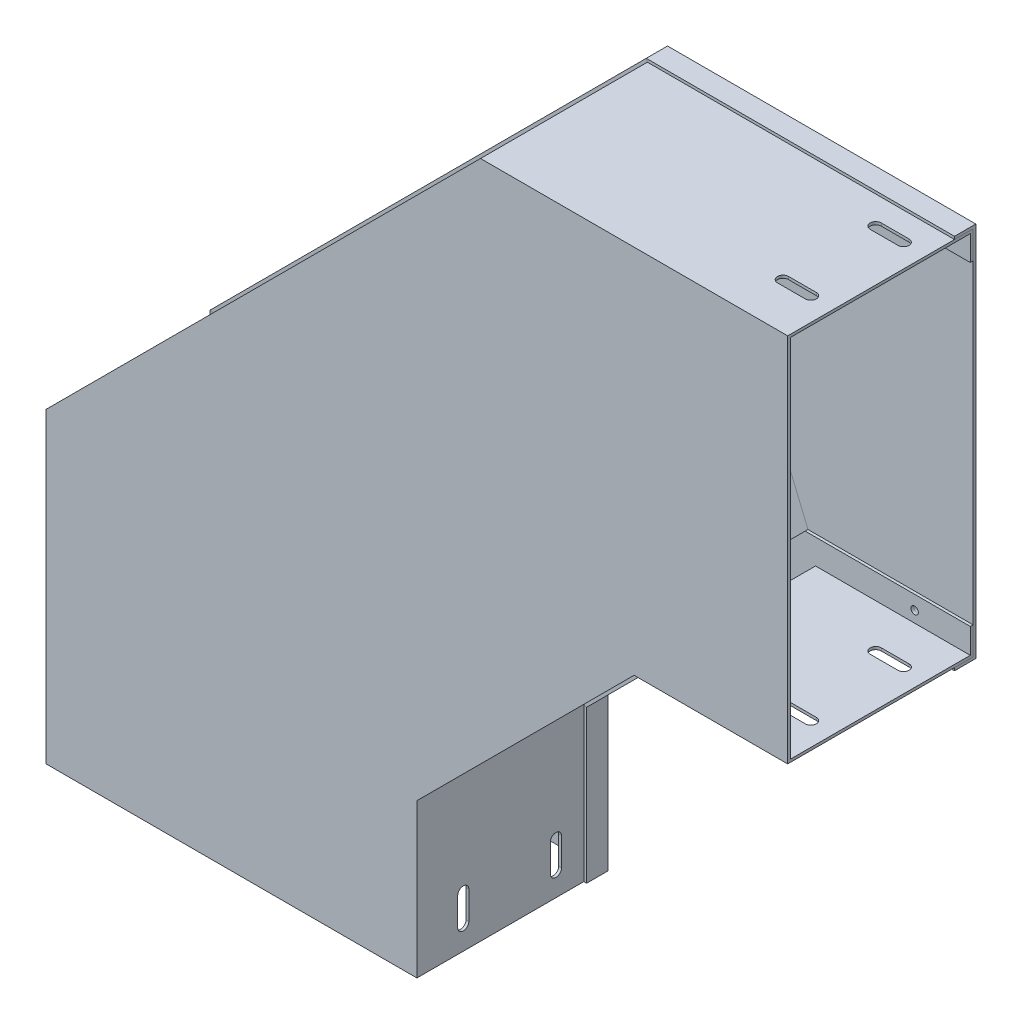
from build123d import *

# Parameters (mm, degrees)
CUT_EXTRUDE1_DEPTH      = 503.493781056
CUT_EXTRUDE1_DEPTH_BACK = 503.493781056
CUT_EXTRUDE2_DEPTH      = 503.493781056
CUT_EXTRUDE2_DEPTH_BACK = 503.493781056
SKETCH4_R               = 2
CUT_EXTRUDE3_DEPTH      = 568.89083458
CUT_EXTRUDE4_REACH      = 569.891
SKETCH5_R               = 2
SKETCH10_R              = 2
CUT_EXTRUDE5_DEPTH      = 571.13748342
SKETCH11_R              = 2
CUT_EXTRUDE6_DEPTH      = 571.13748342


with BuildPart() as part:
    # Sweep1: sweep along a path in ElbowArc
    with BuildLine(Plane.XY) as sweep1_path:
        Line((-300, 0), (-300, 124.264068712))
        Line((-300, 124.264068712), (-124.264068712, 300))
        Line((-124.264068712, 300), (0, 300))
    # Sketch1 → Sweep1 (sweep)
    with BuildSketch(Plane(origin=(0, 0, 0), x_dir=(1, 0, 0), z_dir=(0, 1, 0))):
        Polygon((-200, -50), (-400, -50), (-400, 50), (-385, 50), (-385, 48.5), (-398.5, 48.5), (-398.5, -48.5), (-201.5, -48.5), (-201.5, 48.5), (-215, 48.5), (-215, 50), (-200, 50), align=None)
    sweep(path=sweep1_path.line, transition=Transition.RIGHT)

    # Sketch2 → Cut-Extrude1 (cut, two sides: drawn at the far end of the back side and taken through both)
    with BuildSketch(Plane(origin=(-300, 0, 0), x_dir=(0, 0, -1), z_dir=(1, 0, 0)).offset(-CUT_EXTRUDE1_DEPTH_BACK)):
        with BuildLine():
            Line((-28, 12.5), (-28, 27.5))
            ThreePointArc((-28, 27.5), (-25, 30.5), (-22, 27.5))
            Line((-22, 27.5), (-22, 12.5))
            ThreePointArc((-22, 12.5), (-25, 9.5), (-28, 12.5))
        make_face()
        with BuildLine():
            Line((22, 12.5), (22, 27.5))
            ThreePointArc((22, 27.5), (25, 30.5), (28, 27.5))
            Line((28, 27.5), (28, 12.5))
            ThreePointArc((28, 12.5), (25, 9.5), (22, 12.5))
        make_face()
    extrude(amount=CUT_EXTRUDE1_DEPTH + CUT_EXTRUDE1_DEPTH_BACK, mode=Mode.SUBTRACT)

    # Sketch3 → Cut-Extrude2 (cut, two sides: drawn at the far end of the back side and taken through both)
    with BuildSketch(Plane(origin=(0, 300, 0), x_dir=(-1, 0, 0), z_dir=(0, 1, 0)).offset(-CUT_EXTRUDE2_DEPTH_BACK)):
        with BuildLine():
            Line((12.5, 28), (27.5, 28))
            ThreePointArc((27.5, 28), (30.5, 25), (27.5, 22))
            Line((27.5, 22), (12.5, 22))
            ThreePointArc((12.5, 22), (9.5, 25), (12.5, 28))
        make_face()
        with BuildLine():
            Line((12.5, -22), (27.5, -22))
            ThreePointArc((27.5, -22), (30.5, -25), (27.5, -28))
            Line((27.5, -28), (12.5, -28))
            ThreePointArc((12.5, -28), (9.5, -25), (12.5, -22))
        make_face()
    extrude(amount=CUT_EXTRUDE2_DEPTH + CUT_EXTRUDE2_DEPTH_BACK, mode=Mode.SUBTRACT)

    # Sketch4 → Cut-Extrude3 (cut, through all)
    with BuildSketch(Plane(origin=(0, 0, 0), x_dir=(-1, 0, 0), z_dir=(0, 0, -1))):
        with Locations((392.5, 30)):
            Circle(SKETCH4_R)
        with Locations((207.5, 30)):
            Circle(SKETCH4_R)
    extrude(amount=CUT_EXTRUDE3_DEPTH, mode=Mode.SUBTRACT)

    # Sketch5 → Cut-Extrude4 (cut, up to next)
    with BuildSketch(Plane.XY, mode=Mode.PRIVATE) as cut_extrude4_sk1:
        with Locations((-30, 392.5)):
            Circle(SKETCH5_R)
    cut_extrude4_tool1 = extrude(cut_extrude4_sk1.sketch, amount=-CUT_EXTRUDE4_REACH, mode=Mode.PRIVATE) & part.part
    # Sketch5 → Cut-Extrude4 (cut, up to next)
    with BuildSketch(Plane.XY, mode=Mode.PRIVATE) as cut_extrude4_sk2:
        with Locations((-30, 207.5)):
            Circle(SKETCH5_R)
    cut_extrude4_tool2 = extrude(cut_extrude4_sk2.sketch, amount=-CUT_EXTRUDE4_REACH, mode=Mode.PRIVATE) & part.part
    add(cut_extrude4_tool1.solids().sort_by_distance((-30, 392.5, 0))[0], mode=Mode.SUBTRACT)
    add(cut_extrude4_tool2.solids().sort_by_distance((-30, 207.5, 0))[0], mode=Mode.SUBTRACT)


with BuildPart() as body_2:
    # Sweep2: sweep along a path in ElbowArc_2
    with BuildLine(Plane.XY) as sweep2_path:
        Line((-300, 0), (-300, 124.264068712))
        Line((-300, 124.264068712), (-124.264068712, 300))
        Line((-124.264068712, 300), (0, 300))
    # Sketch8 → Sweep2 (sweep)
    with BuildSketch(Plane(origin=(0, 0, 0), x_dir=(1, 0, 0), z_dir=(0, 1, 0))):
        Polygon((-400, 40), (-400, 50), (-200, 50), (-200, 40), (-198.5, 40), (-198.5, 51.5), (-401.5, 51.5), (-401.5, 40), align=None)
    sweep(path=sweep2_path.line, transition=Transition.RIGHT)

    # Sketch10 → Cut-Extrude5 (cut, through all)
    with BuildSketch(Plane(origin=(0, 0, 0), x_dir=(0, 1, 0), z_dir=(0, 0, 1))):
        with Locations(Location((30, 207.5, 0), (0, 0, 270))):
            Circle(SKETCH10_R)
        with Locations(Location((30, 392.5, 0), (0, 0, 270))):
            Circle(SKETCH10_R)
    extrude(amount=-CUT_EXTRUDE5_DEPTH, mode=Mode.SUBTRACT)

    # Sketch11 → Cut-Extrude6 (cut, through all)
    with BuildSketch(Plane.XY):
        with Locations((-30, 207.5)):
            Circle(SKETCH11_R)
        with Locations((-30, 392.5)):
            Circle(SKETCH11_R)
    extrude(amount=-CUT_EXTRUDE6_DEPTH, mode=Mode.SUBTRACT)


solid = Compound([part.part, body_2.part])
